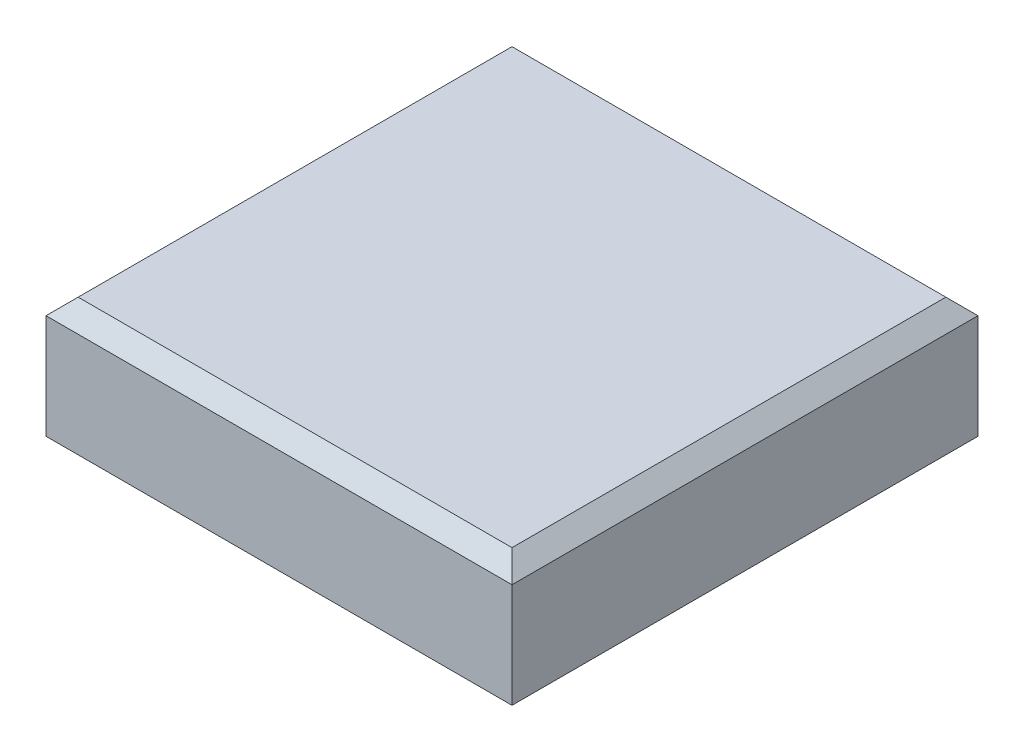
ISO-10303-21;
HEADER;
FILE_DESCRIPTION(('STEP AP214'),'2;1');
FILE_NAME('part.step','',(''),(''),'','','');
FILE_SCHEMA(('AUTOMOTIVE_DESIGN { 1 0 10303 214 1 1 1 1 }'));
ENDSEC;
DATA;
#1=APPLICATION_CONTEXT('core data for automotive mechanical design processes');
#2=APPLICATION_PROTOCOL_DEFINITION('international standard','automotive_design',2000,#1);
#3=PRODUCT_CONTEXT('',#1,'mechanical');
#4=PRODUCT('Part','Part','',(#3));
#5=PRODUCT_RELATED_PRODUCT_CATEGORY('part','',(#4));
#6=PRODUCT_DEFINITION_FORMATION('','',#4);
#7=PRODUCT_DEFINITION_CONTEXT('part definition',#1,'design');
#8=PRODUCT_DEFINITION('design','',#6,#7);
#9=PRODUCT_DEFINITION_SHAPE('','',#8);
#10=(LENGTH_UNIT() NAMED_UNIT(*) SI_UNIT(.MILLI.,.METRE.));
#11=(NAMED_UNIT(*) PLANE_ANGLE_UNIT() SI_UNIT($,.RADIAN.));
#12=(NAMED_UNIT(*) SI_UNIT($,.STERADIAN.) SOLID_ANGLE_UNIT());
#13=UNCERTAINTY_MEASURE_WITH_UNIT(LENGTH_MEASURE(1.E-05),#10,'distance_accuracy_value','');
#14=(GEOMETRIC_REPRESENTATION_CONTEXT(3) GLOBAL_UNCERTAINTY_ASSIGNED_CONTEXT((#13)) GLOBAL_UNIT_ASSIGNED_CONTEXT((#10,
#11,#12)) REPRESENTATION_CONTEXT('',''));
#15=CARTESIAN_POINT('',(0.,0.,0.));
#16=DIRECTION('',(0.,0.,1.));
#17=DIRECTION('',(1.,0.,0.));
#18=AXIS2_PLACEMENT_3D('',#15,#16,#17);
#19=CARTESIAN_POINT('',(-145.,75.,-290.));
#20=DIRECTION('',(1.,0.,0.));
#21=DIRECTION('',(0.,0.,-1.));
#22=AXIS2_PLACEMENT_3D('',#19,#20,#21);
#23=PLANE('',#22);
#24=DIRECTION('',(0.,-1.,0.));
#25=VECTOR('',#24,1.);
#26=CARTESIAN_POINT('',(-145.,75.,0.));
#27=LINE('',#26,#25);
#28=CARTESIAN_POINT('',(-145.,64.9999999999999,0.));
#29=VERTEX_POINT('',#28);
#30=CARTESIAN_POINT('',(-145.,0.,0.));
#31=VERTEX_POINT('',#30);
#32=EDGE_CURVE('E86',#29,#31,#27,.T.);
#33=ORIENTED_EDGE('',*,*,#32,.F.);
#34=DIRECTION('',(0.,0.,-1.));
#35=VECTOR('',#34,1.);
#36=CARTESIAN_POINT('',(-145.,64.9999999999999,-290.));
#37=LINE('',#36,#35);
#38=CARTESIAN_POINT('',(-145.,64.9999999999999,-290.));
#39=VERTEX_POINT('',#38);
#40=EDGE_CURVE('E11',#29,#39,#37,.T.);
#41=ORIENTED_EDGE('',*,*,#40,.T.);
#42=DIRECTION('',(0.,-1.,0.));
#43=VECTOR('',#42,1.);
#44=CARTESIAN_POINT('',(-145.,75.,-290.));
#45=LINE('',#44,#43);
#46=CARTESIAN_POINT('',(-145.,0.,-290.));
#47=VERTEX_POINT('',#46);
#48=EDGE_CURVE('E106',#39,#47,#45,.T.);
#49=ORIENTED_EDGE('',*,*,#48,.T.);
#50=DIRECTION('',(0.,0.,1.));
#51=VECTOR('',#50,1.);
#52=CARTESIAN_POINT('',(-145.,0.,-290.));
#53=LINE('',#52,#51);
#54=EDGE_CURVE('E102',#47,#31,#53,.T.);
#55=ORIENTED_EDGE('',*,*,#54,.T.);
#56=EDGE_LOOP('',(#33,#41,#49,#55));
#57=FACE_BOUND('',#56,.T.);
#58=ADVANCED_FACE('F33',(#57),#23,.F.);
#59=CARTESIAN_POINT('',(-145.,75.,0.));
#60=DIRECTION('',(0.,0.,-1.));
#61=DIRECTION('',(-1.,0.,0.));
#62=AXIS2_PLACEMENT_3D('',#59,#60,#61);
#63=PLANE('',#62);
#64=DIRECTION('',(0.,-1.,0.));
#65=VECTOR('',#64,1.);
#66=CARTESIAN_POINT('',(145.,75.,0.));
#67=LINE('',#66,#65);
#68=CARTESIAN_POINT('',(145.,64.9999999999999,0.));
#69=VERTEX_POINT('',#68);
#70=CARTESIAN_POINT('',(145.,0.,0.));
#71=VERTEX_POINT('',#70);
#72=EDGE_CURVE('E96',#69,#71,#67,.T.);
#73=ORIENTED_EDGE('',*,*,#72,.F.);
#74=DIRECTION('',(-1.,0.,0.));
#75=VECTOR('',#74,1.);
#76=CARTESIAN_POINT('',(-145.,64.9999999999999,0.));
#77=LINE('',#76,#75);
#78=EDGE_CURVE('E93',#69,#29,#77,.T.);
#79=ORIENTED_EDGE('',*,*,#78,.T.);
#80=ORIENTED_EDGE('',*,*,#32,.T.);
#81=DIRECTION('',(1.,0.,0.));
#82=VECTOR('',#81,1.);
#83=CARTESIAN_POINT('',(-145.,0.,0.));
#84=LINE('',#83,#82);
#85=EDGE_CURVE('E90',#31,#71,#84,.T.);
#86=ORIENTED_EDGE('',*,*,#85,.T.);
#87=EDGE_LOOP('',(#73,#79,#80,#86));
#88=FACE_BOUND('',#87,.T.);
#89=ADVANCED_FACE('F89',(#88),#63,.F.);
#90=CARTESIAN_POINT('',(145.,75.,-290.));
#91=DIRECTION('',(-1.,0.,0.));
#92=DIRECTION('',(0.,0.,1.));
#93=AXIS2_PLACEMENT_3D('',#90,#91,#92);
#94=PLANE('',#93);
#95=DIRECTION('',(0.,-1.,0.));
#96=VECTOR('',#95,1.);
#97=CARTESIAN_POINT('',(145.,75.,-290.));
#98=LINE('',#97,#96);
#99=CARTESIAN_POINT('',(145.,64.9999999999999,-290.));
#100=VERTEX_POINT('',#99);
#101=CARTESIAN_POINT('',(145.,0.,-290.));
#102=VERTEX_POINT('',#101);
#103=EDGE_CURVE('E116',#100,#102,#98,.T.);
#104=ORIENTED_EDGE('',*,*,#103,.F.);
#105=DIRECTION('',(0.,0.,1.));
#106=VECTOR('',#105,1.);
#107=CARTESIAN_POINT('',(145.,64.9999999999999,0.));
#108=LINE('',#107,#106);
#109=EDGE_CURVE('E128',#100,#69,#108,.T.);
#110=ORIENTED_EDGE('',*,*,#109,.T.);
#111=ORIENTED_EDGE('',*,*,#72,.T.);
#112=DIRECTION('',(0.,0.,-1.));
#113=VECTOR('',#112,1.);
#114=CARTESIAN_POINT('',(145.,0.,-290.));
#115=LINE('',#114,#113);
#116=EDGE_CURVE('E104',#71,#102,#115,.T.);
#117=ORIENTED_EDGE('',*,*,#116,.T.);
#118=EDGE_LOOP('',(#104,#110,#111,#117));
#119=FACE_BOUND('',#118,.T.);
#120=ADVANCED_FACE('F164',(#119),#94,.F.);
#121=CARTESIAN_POINT('',(-145.,75.,-290.));
#122=DIRECTION('',(0.,0.,1.));
#123=DIRECTION('',(1.,0.,0.));
#124=AXIS2_PLACEMENT_3D('',#121,#122,#123);
#125=PLANE('',#124);
#126=ORIENTED_EDGE('',*,*,#48,.F.);
#127=DIRECTION('',(1.,0.,0.));
#128=VECTOR('',#127,1.);
#129=CARTESIAN_POINT('',(145.,64.9999999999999,-290.));
#130=LINE('',#129,#128);
#131=EDGE_CURVE('E42',#39,#100,#130,.T.);
#132=ORIENTED_EDGE('',*,*,#131,.T.);
#133=ORIENTED_EDGE('',*,*,#103,.T.);
#134=DIRECTION('',(-1.,0.,0.));
#135=VECTOR('',#134,1.);
#136=CARTESIAN_POINT('',(-145.,0.,-290.));
#137=LINE('',#136,#135);
#138=EDGE_CURVE('E113',#102,#47,#137,.T.);
#139=ORIENTED_EDGE('',*,*,#138,.T.);
#140=EDGE_LOOP('',(#126,#132,#133,#139));
#141=FACE_BOUND('',#140,.T.);
#142=ADVANCED_FACE('F196',(#141),#125,.F.);
#143=CARTESIAN_POINT('',(0.,75.,0.));
#144=DIRECTION('',(0.,1.,0.));
#145=DIRECTION('',(0.,0.,1.));
#146=AXIS2_PLACEMENT_3D('',#143,#144,#145);
#147=PLANE('',#146);
#148=DIRECTION('',(0.,0.,1.));
#149=VECTOR('',#148,1.);
#150=CARTESIAN_POINT('',(-135.,75.,0.));
#151=LINE('',#150,#149);
#152=CARTESIAN_POINT('',(-135.,75.,-280.));
#153=VERTEX_POINT('',#152);
#154=CARTESIAN_POINT('',(-135.,75.,-10.0000000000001));
#155=VERTEX_POINT('',#154);
#156=EDGE_CURVE('E95',#153,#155,#151,.T.);
#157=ORIENTED_EDGE('',*,*,#156,.T.);
#158=DIRECTION('',(1.,0.,0.));
#159=VECTOR('',#158,1.);
#160=CARTESIAN_POINT('',(145.,75.,-10.0000000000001));
#161=LINE('',#160,#159);
#162=CARTESIAN_POINT('',(135.,75.,-10.0000000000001));
#163=VERTEX_POINT('',#162);
#164=EDGE_CURVE('E124',#155,#163,#161,.T.);
#165=ORIENTED_EDGE('',*,*,#164,.T.);
#166=DIRECTION('',(0.,0.,-1.));
#167=VECTOR('',#166,1.);
#168=CARTESIAN_POINT('',(135.,75.,-290.));
#169=LINE('',#168,#167);
#170=CARTESIAN_POINT('',(135.,75.,-280.));
#171=VERTEX_POINT('',#170);
#172=EDGE_CURVE('E122',#163,#171,#169,.T.);
#173=ORIENTED_EDGE('',*,*,#172,.T.);
#174=DIRECTION('',(-1.,0.,0.));
#175=VECTOR('',#174,1.);
#176=CARTESIAN_POINT('',(-145.,75.,-280.));
#177=LINE('',#176,#175);
#178=EDGE_CURVE('E120',#171,#153,#177,.T.);
#179=ORIENTED_EDGE('',*,*,#178,.T.);
#180=EDGE_LOOP('',(#157,#165,#173,#179));
#181=FACE_BOUND('',#180,.T.);
#182=ADVANCED_FACE('F146',(#181),#147,.T.);
#183=CARTESIAN_POINT('',(0.,0.,0.));
#184=DIRECTION('',(0.,1.,0.));
#185=DIRECTION('',(0.,0.,1.));
#186=AXIS2_PLACEMENT_3D('',#183,#184,#185);
#187=PLANE('',#186);
#188=ORIENTED_EDGE('',*,*,#54,.F.);
#189=ORIENTED_EDGE('',*,*,#138,.F.);
#190=ORIENTED_EDGE('',*,*,#116,.F.);
#191=ORIENTED_EDGE('',*,*,#85,.F.);
#192=EDGE_LOOP('',(#188,#189,#190,#191));
#193=FACE_BOUND('',#192,.T.);
#194=ADVANCED_FACE('F100',(#193),#187,.F.);
#195=CARTESIAN_POINT('',(0.,75.,-280.));
#196=DIRECTION('',(0.,0.707106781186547,-0.707106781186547));
#197=DIRECTION('',(1.,0.,0.));
#198=AXIS2_PLACEMENT_3D('',#195,#196,#197);
#199=PLANE('',#198);
#200=DIRECTION('',(0.577350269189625,-0.577350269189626,-0.577350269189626));
#201=VECTOR('',#200,1.);
#202=CARTESIAN_POINT('',(90.0000000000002,120.,-235.));
#203=LINE('',#202,#201);
#204=EDGE_CURVE('E110',#100,#171,#203,.F.);
#205=ORIENTED_EDGE('',*,*,#204,.F.);
#206=ORIENTED_EDGE('',*,*,#131,.F.);
#207=DIRECTION('',(-0.577350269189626,-0.577350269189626,-0.577350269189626));
#208=VECTOR('',#207,1.);
#209=CARTESIAN_POINT('',(-41.6666666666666,168.333333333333,-186.666666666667));
#210=LINE('',#209,#208);
#211=EDGE_CURVE('E37',#153,#39,#210,.T.);
#212=ORIENTED_EDGE('',*,*,#211,.F.);
#213=ORIENTED_EDGE('',*,*,#178,.F.);
#214=EDGE_LOOP('',(#205,#206,#212,#213));
#215=FACE_BOUND('',#214,.T.);
#216=ADVANCED_FACE('F35',(#215),#199,.T.);
#217=CARTESIAN_POINT('',(-135.,75.,0.));
#218=DIRECTION('',(-0.707106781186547,0.707106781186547,0.));
#219=DIRECTION('',(0.,0.,-1.));
#220=AXIS2_PLACEMENT_3D('',#217,#218,#219);
#221=PLANE('',#220);
#222=ORIENTED_EDGE('',*,*,#211,.T.);
#223=ORIENTED_EDGE('',*,*,#40,.F.);
#224=DIRECTION('',(0.577350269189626,0.577350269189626,-0.577350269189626));
#225=VECTOR('',#224,1.);
#226=CARTESIAN_POINT('',(-138.333333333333,71.6666666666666,-6.66666666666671));
#227=LINE('',#226,#225);
#228=EDGE_CURVE('E133',#155,#29,#227,.F.);
#229=ORIENTED_EDGE('',*,*,#228,.F.);
#230=ORIENTED_EDGE('',*,*,#156,.F.);
#231=EDGE_LOOP('',(#222,#223,#229,#230));
#232=FACE_BOUND('',#231,.T.);
#233=ADVANCED_FACE('F152',(#232),#221,.T.);
#234=CARTESIAN_POINT('',(135.,75.,0.));
#235=DIRECTION('',(0.707106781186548,0.707106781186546,0.));
#236=DIRECTION('',(0.,0.,1.));
#237=AXIS2_PLACEMENT_3D('',#234,#235,#236);
#238=PLANE('',#237);
#239=ORIENTED_EDGE('',*,*,#204,.T.);
#240=ORIENTED_EDGE('',*,*,#172,.F.);
#241=DIRECTION('',(0.577350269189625,-0.577350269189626,0.577350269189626));
#242=VECTOR('',#241,1.);
#243=CARTESIAN_POINT('',(138.333333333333,71.6666666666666,-6.66666666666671));
#244=LINE('',#243,#242);
#245=EDGE_CURVE('E131',#69,#163,#244,.F.);
#246=ORIENTED_EDGE('',*,*,#245,.F.);
#247=ORIENTED_EDGE('',*,*,#109,.F.);
#248=EDGE_LOOP('',(#239,#240,#246,#247));
#249=FACE_BOUND('',#248,.T.);
#250=ADVANCED_FACE('F139',(#249),#238,.T.);
#251=CARTESIAN_POINT('',(0.,75.,-10.0000000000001));
#252=DIRECTION('',(0.,0.707106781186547,0.707106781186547));
#253=DIRECTION('',(-1.,0.,0.));
#254=AXIS2_PLACEMENT_3D('',#251,#252,#253);
#255=PLANE('',#254);
#256=ORIENTED_EDGE('',*,*,#228,.T.);
#257=ORIENTED_EDGE('',*,*,#78,.F.);
#258=ORIENTED_EDGE('',*,*,#245,.T.);
#259=ORIENTED_EDGE('',*,*,#164,.F.);
#260=EDGE_LOOP('',(#256,#257,#258,#259));
#261=FACE_BOUND('',#260,.T.);
#262=ADVANCED_FACE('F150',(#261),#255,.T.);
#263=CLOSED_SHELL('',(#58,#89,#120,#142,#182,#194,#216,#233,#250,#262));
#264=MANIFOLD_SOLID_BREP('B2',#263);
#265=ADVANCED_BREP_SHAPE_REPRESENTATION('',(#18,#264),#14);
#266=SHAPE_DEFINITION_REPRESENTATION(#9,#265);
ENDSEC;
END-ISO-10303-21;
